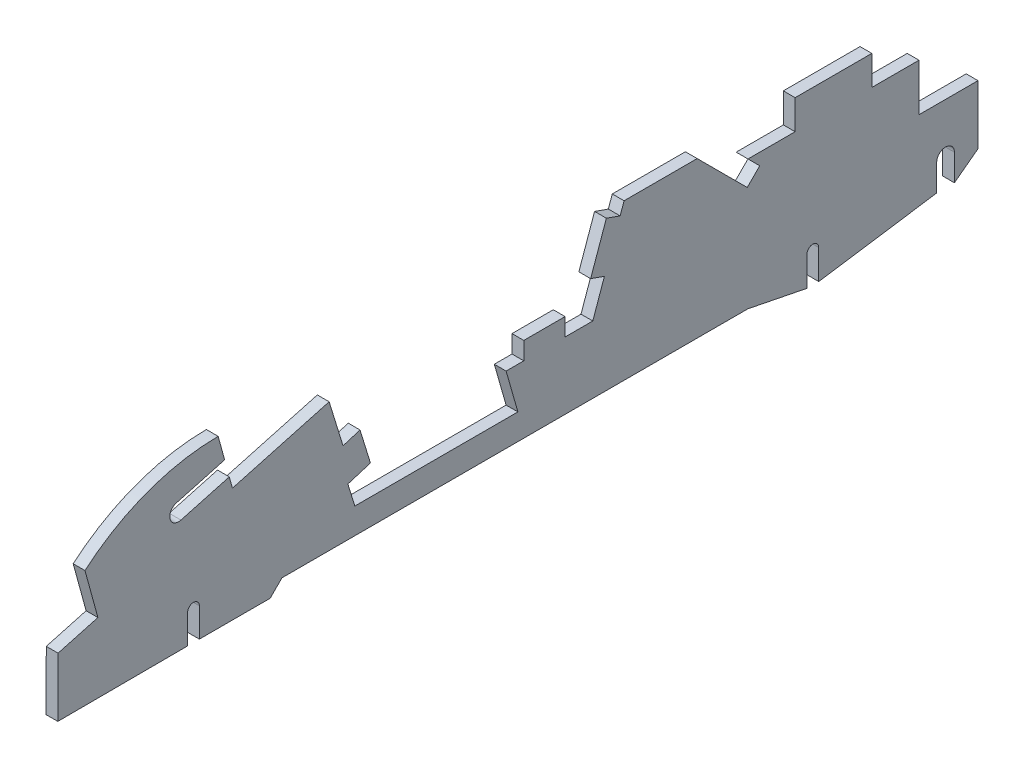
from build123d import *

# Parameters (mm, degrees)
RESSALTO_EXTRUS_O1_DEPTH = 2


with BuildPart() as part:
    # Esbo_o1 → Ressalto-extrus_o1 (new body)
    with BuildSketch(Plane(origin=(0, 0, 0), x_dir=(0, 0, -1), z_dir=(1, 0, 0))):
        with BuildLine():
            Line((0, 0), (-10, 0))
            Line((-10, 0), (-10, 8))
            Line((-10, 8), (-18, 8))
            Line((-18, 8), (-18, 13))
            Line((-18, 13), (-31, 13))
            Line((-31, 13), (-31, 8))
            Line((-31, 8), (-39, 8))
            Line((-39, 8), (-37, 6))
            Line((-37, 6), (-39.121320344, 3.878679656))
            Line((-39.121320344, 3.878679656), (-47.606601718, 12.363961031))
            Line((-47.606601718, 12.363961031), (-60, 12.363961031))
            Line((-60, 12.363961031), (-60.666666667, 10.478342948))
            Line((-60.666666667, 10.478342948), (-63, 11.303300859))
            Line((-63, 11.303300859), (-65.666666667, 3.760828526))
            Line((-65.666666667, 3.760828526), (-63.333333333, 2.935870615))
            Line((-63.333333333, 2.935870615), (-65.303300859, -2.636038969))
            Line((-65.303300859, -2.636038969), (-70, -2.636038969))
            Line((-70, -2.636038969), (-70, 0.363961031))
            Line((-70, 0.363961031), (-77, 0.363961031))
            Line((-77, 0.363961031), (-77, -2.636038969))
            Line((-77, -2.636038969), (-80, -2.636038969))
            Line((-80, -2.636038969), (-78, -9.636038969))
            Line((-78, -9.636038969), (-105.645751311, -9.636038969))
            Line((-105.645751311, -9.636038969), (-106.822875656, -5.813163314))
            Line((-106.822875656, -5.813163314), (-103, -4.636038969))
            Line((-103, -4.636038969), (-104.765686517, 1.098274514))
            Line((-104.765686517, 1.098274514), (-107.645751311, 0.21145666))
            Line((-107.645751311, 0.21145666), (-110, 7.857207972))
            Line((-110, 7.857207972), (-126.395448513, 3.363961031))
            Line((-126.395448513, 3.363961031), (-126.9240658, 5.292837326))
            Line((-126.9240658, 5.292837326), (-135.121790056, 3.046213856))
            ThreePointArc((-135.121790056, 3.046213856), (-136.964910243, 4.096408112), (-135.914715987, 5.939528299))
            Line((-135.914715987, 5.939528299), (-127.71699173, 8.18615177))
            Line((-127.71699173, 8.18615177), (-128.813209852, 12.18615177))
            ThreePointArc((-128.813209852, 12.18615177), (-140.849618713, 9.983199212), (-151.392124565, 3.771620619))
            Line((-151.392124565, 3.771620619), (-149.199688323, -4.228379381))
            Line((-149.199688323, -4.228379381), (-155.950755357, -6.078539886))
            Line((-155.950755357, -6.078539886), (-156, -16.078539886))
            Line((-156, -16.078539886), (-134, -16))
            Line((-134, -16), (-134, -11.101020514))
            ThreePointArc((-134, -11.101020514), (-133, -10.101020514), (-132, -11.101020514))
            Line((-132, -11.101020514), (-132, -16))
            Line((-132, -16), (-120, -16))
            Line((-120, -16), (-118, -14))
            Line((-118, -14), (-39, -14))
            Line((-39, -14), (-29, -16))
            Line((-29, -16), (-29, -11))
            ThreePointArc((-29, -11), (-28, -10), (-27, -11))
            Line((-27, -11), (-27, -16))
            Line((-27, -16), (-7, -13))
            Line((-7, -13), (-7, -8.5))
            ThreePointArc((-7, -8.5), (-5.5, -7), (-4, -8.5))
            Line((-4, -8.5), (-4, -13))
            Line((-4, -13), (0, -10))
            Line((0, -10), (0, 0))
        make_face()
    extrude(amount=RESSALTO_EXTRUS_O1_DEPTH)


solid = part.part
